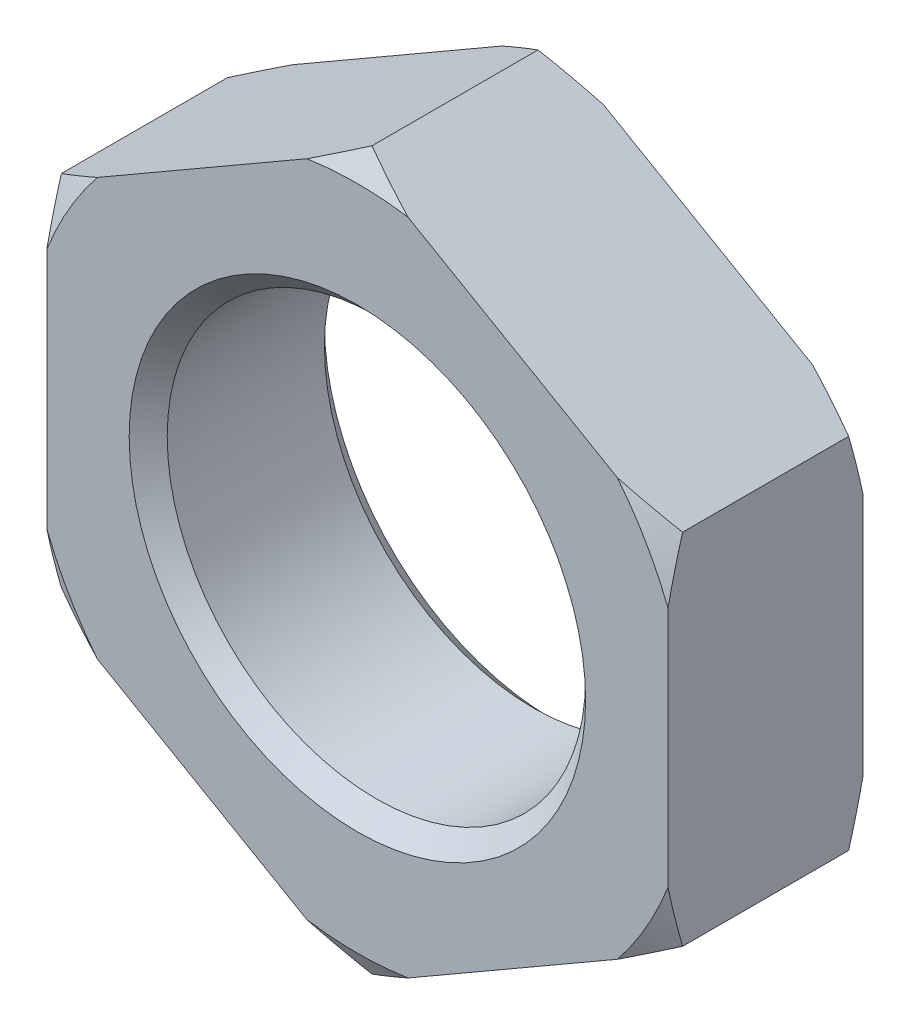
from build123d import *

# Parameters (mm, degrees)
SKETCH1_R           = 16.5
BOSS_EXTRUDE1_DEPTH = 7.7
CHAMFER1_SIZE       = 1.5


with BuildPart() as part:
    # Sketch1 → Boss-Extrude1 (new, symmetric)
    with BuildSketch(Plane.XY):
        Polygon((0, 28.29016319), (-24.5, 14.145081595), (-24.5, -14.145081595), (0, -28.29016319), (24.5, -14.145081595), (24.5, 14.145081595), align=None)
        with Locations(Location((0, 0, 0), (0, 0, 180))):
            Circle(SKETCH1_R, mode=Mode.SUBTRACT)
    extrude(amount=BOSS_EXTRUDE1_DEPTH, both=True)

    # Sketch3 → Cut-Revolve1 (revolve, cut)
    with BuildSketch(Plane(origin=(0, 0, 0), x_dir=(0, 0, -1), z_dir=(1, 0, 0))):
        Polygon((-7.7, 28.29016319), (-7.7, 26.29016319), (-6.545299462, 28.29016319), align=None)
    cut_revolve1 = revolve(axis=Axis((0, 0, -7.477018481), (0, 0, 1)), mode=Mode.SUBTRACT)

    # Mirror1: Cut-Revolve1 across plane
    add(cut_revolve1.mirror(Plane.XY), mode=Mode.SUBTRACT)

    # Chamfer1
    chamfer1_edges = [part.edges().sort_by_distance(p)[0] for p in [
        (16.5, 0, -7.7),
        (16.5, 0, 7.7),
    ]]
    chamfer(chamfer1_edges, length=CHAMFER1_SIZE)


solid = part.part
